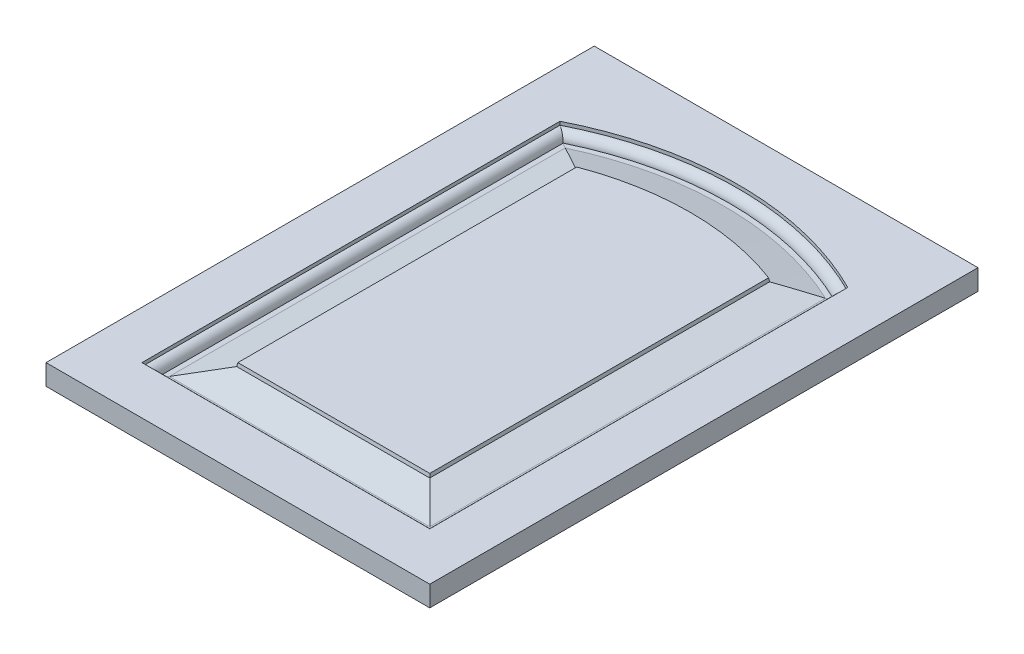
ISO-10303-21;
HEADER;
FILE_DESCRIPTION(('STEP AP214'),'2;1');
FILE_NAME('part.step','',(''),(''),'','','');
FILE_SCHEMA(('AUTOMOTIVE_DESIGN { 1 0 10303 214 1 1 1 1 }'));
ENDSEC;
DATA;
#1=APPLICATION_CONTEXT('core data for automotive mechanical design processes');
#2=APPLICATION_PROTOCOL_DEFINITION('international standard','automotive_design',2000,#1);
#3=PRODUCT_CONTEXT('',#1,'mechanical');
#4=PRODUCT('Part','Part','',(#3));
#5=PRODUCT_RELATED_PRODUCT_CATEGORY('part','',(#4));
#6=PRODUCT_DEFINITION_FORMATION('','',#4);
#7=PRODUCT_DEFINITION_CONTEXT('part definition',#1,'design');
#8=PRODUCT_DEFINITION('design','',#6,#7);
#9=PRODUCT_DEFINITION_SHAPE('','',#8);
#10=(LENGTH_UNIT() NAMED_UNIT(*) SI_UNIT(.MILLI.,.METRE.));
#11=(NAMED_UNIT(*) PLANE_ANGLE_UNIT() SI_UNIT($,.RADIAN.));
#12=(NAMED_UNIT(*) SI_UNIT($,.STERADIAN.) SOLID_ANGLE_UNIT());
#13=UNCERTAINTY_MEASURE_WITH_UNIT(LENGTH_MEASURE(1.E-05),#10,'distance_accuracy_value','');
#14=(GEOMETRIC_REPRESENTATION_CONTEXT(3) GLOBAL_UNCERTAINTY_ASSIGNED_CONTEXT((#13)) GLOBAL_UNIT_ASSIGNED_CONTEXT((#10,
#11,#12)) REPRESENTATION_CONTEXT('',''));
#15=CARTESIAN_POINT('',(0.,0.,0.));
#16=DIRECTION('',(0.,0.,1.));
#17=DIRECTION('',(1.,0.,0.));
#18=AXIS2_PLACEMENT_3D('',#15,#16,#17);
#19=CARTESIAN_POINT('',(0.,19.05,0.));
#20=DIRECTION('',(0.,-1.,0.));
#21=DIRECTION('',(0.,0.,-1.));
#22=AXIS2_PLACEMENT_3D('',#19,#20,#21);
#23=PLANE('',#22);
#24=DIRECTION('',(0.,0.,1.));
#25=VECTOR('',#24,1.);
#26=CARTESIAN_POINT('',(-177.8,19.05,0.));
#27=LINE('',#26,#25);
#28=CARTESIAN_POINT('',(-177.8,19.05,-508.));
#29=VERTEX_POINT('',#28);
#30=CARTESIAN_POINT('',(-177.8,19.05,0.));
#31=VERTEX_POINT('',#30);
#32=EDGE_CURVE('E338',#29,#31,#27,.T.);
#33=ORIENTED_EDGE('',*,*,#32,.T.);
#34=DIRECTION('',(1.,0.,0.));
#35=VECTOR('',#34,1.);
#36=CARTESIAN_POINT('',(-177.8,19.05,0.));
#37=LINE('',#36,#35);
#38=CARTESIAN_POINT('',(177.8,19.05,0.));
#39=VERTEX_POINT('',#38);
#40=EDGE_CURVE('E706',#31,#39,#37,.T.);
#41=ORIENTED_EDGE('',*,*,#40,.T.);
#42=DIRECTION('',(0.,0.,-1.));
#43=VECTOR('',#42,1.);
#44=CARTESIAN_POINT('',(177.8,19.05,0.));
#45=LINE('',#44,#43);
#46=CARTESIAN_POINT('',(177.8,19.05,-508.));
#47=VERTEX_POINT('',#46);
#48=EDGE_CURVE('E690',#39,#47,#45,.T.);
#49=ORIENTED_EDGE('',*,*,#48,.T.);
#50=DIRECTION('',(-1.,0.,0.));
#51=VECTOR('',#50,1.);
#52=CARTESIAN_POINT('',(-177.8,19.05,-508.));
#53=LINE('',#52,#51);
#54=EDGE_CURVE('E701',#47,#29,#53,.T.);
#55=ORIENTED_EDGE('',*,*,#54,.T.);
#56=EDGE_LOOP('',(#33,#41,#49,#55));
#57=FACE_BOUND('',#56,.T.);
#58=DIRECTION('',(0.,0.,1.));
#59=VECTOR('',#58,1.);
#60=CARTESIAN_POINT('',(-133.35,19.05,-431.8));
#61=LINE('',#60,#59);
#62=CARTESIAN_POINT('',(-133.35,19.05,-431.8));
#63=VERTEX_POINT('',#62);
#64=CARTESIAN_POINT('',(-133.35,19.05,-44.4499999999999));
#65=VERTEX_POINT('',#64);
#66=EDGE_CURVE('E330',#63,#65,#61,.T.);
#67=ORIENTED_EDGE('',*,*,#66,.F.);
#68=CARTESIAN_POINT('',(0.,19.05,-167.64));
#69=DIRECTION('',(0.,1.,0.));
#70=DIRECTION('',(0.450643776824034,0.,-0.892703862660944));
#71=AXIS2_PLACEMENT_3D('',#68,#69,#70);
#72=CIRCLE('',#71,295.91);
#73=CARTESIAN_POINT('',(133.35,19.05,-431.8));
#74=VERTEX_POINT('',#73);
#75=EDGE_CURVE('E376',#74,#63,#72,.T.);
#76=ORIENTED_EDGE('',*,*,#75,.F.);
#77=DIRECTION('',(0.,0.,-1.));
#78=VECTOR('',#77,1.);
#79=CARTESIAN_POINT('',(133.35,19.05,-44.45));
#80=LINE('',#79,#78);
#81=CARTESIAN_POINT('',(133.35,19.05,-44.45));
#82=VERTEX_POINT('',#81);
#83=EDGE_CURVE('E505',#82,#74,#80,.T.);
#84=ORIENTED_EDGE('',*,*,#83,.F.);
#85=DIRECTION('',(1.,0.,0.));
#86=VECTOR('',#85,1.);
#87=CARTESIAN_POINT('',(-133.35,19.05,-44.4499999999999));
#88=LINE('',#87,#86);
#89=EDGE_CURVE('E271',#65,#82,#88,.T.);
#90=ORIENTED_EDGE('',*,*,#89,.F.);
#91=EDGE_LOOP('',(#67,#76,#84,#90));
#92=FACE_BOUND('',#91,.T.);
#93=ADVANCED_FACE('F34',(#57,#92),#23,.F.);
#94=CARTESIAN_POINT('',(-177.8,19.05,0.));
#95=DIRECTION('',(1.,0.,0.));
#96=DIRECTION('',(0.,0.,-1.));
#97=AXIS2_PLACEMENT_3D('',#94,#95,#96);
#98=PLANE('',#97);
#99=DIRECTION('',(0.,0.,1.));
#100=VECTOR('',#99,1.);
#101=CARTESIAN_POINT('',(-177.8,0.,0.));
#102=LINE('',#101,#100);
#103=CARTESIAN_POINT('',(-177.8,0.,-508.));
#104=VERTEX_POINT('',#103);
#105=CARTESIAN_POINT('',(-177.8,0.,0.));
#106=VERTEX_POINT('',#105);
#107=EDGE_CURVE('E184',#104,#106,#102,.T.);
#108=ORIENTED_EDGE('',*,*,#107,.T.);
#109=DIRECTION('',(0.,-1.,0.));
#110=VECTOR('',#109,1.);
#111=CARTESIAN_POINT('',(-177.8,19.05,0.));
#112=LINE('',#111,#110);
#113=EDGE_CURVE('E11',#31,#106,#112,.T.);
#114=ORIENTED_EDGE('',*,*,#113,.F.);
#115=ORIENTED_EDGE('',*,*,#32,.F.);
#116=DIRECTION('',(0.,-1.,0.));
#117=VECTOR('',#116,1.);
#118=CARTESIAN_POINT('',(-177.8,19.05,-508.));
#119=LINE('',#118,#117);
#120=EDGE_CURVE('E698',#29,#104,#119,.T.);
#121=ORIENTED_EDGE('',*,*,#120,.T.);
#122=EDGE_LOOP('',(#108,#114,#115,#121));
#123=FACE_BOUND('',#122,.T.);
#124=ADVANCED_FACE('F36',(#123),#98,.F.);
#125=CARTESIAN_POINT('',(-177.8,19.05,0.));
#126=DIRECTION('',(0.,0.,-1.));
#127=DIRECTION('',(-1.,0.,0.));
#128=AXIS2_PLACEMENT_3D('',#125,#126,#127);
#129=PLANE('',#128);
#130=DIRECTION('',(1.,0.,0.));
#131=VECTOR('',#130,1.);
#132=CARTESIAN_POINT('',(-177.8,0.,0.));
#133=LINE('',#132,#131);
#134=CARTESIAN_POINT('',(177.8,0.,0.));
#135=VERTEX_POINT('',#134);
#136=EDGE_CURVE('E679',#106,#135,#133,.T.);
#137=ORIENTED_EDGE('',*,*,#136,.T.);
#138=DIRECTION('',(0.,-1.,0.));
#139=VECTOR('',#138,1.);
#140=CARTESIAN_POINT('',(177.8,19.05,0.));
#141=LINE('',#140,#139);
#142=EDGE_CURVE('E42',#39,#135,#141,.T.);
#143=ORIENTED_EDGE('',*,*,#142,.F.);
#144=ORIENTED_EDGE('',*,*,#40,.F.);
#145=ORIENTED_EDGE('',*,*,#113,.T.);
#146=EDGE_LOOP('',(#137,#143,#144,#145));
#147=FACE_BOUND('',#146,.T.);
#148=ADVANCED_FACE('F441',(#147),#129,.F.);
#149=CARTESIAN_POINT('',(177.8,19.05,0.));
#150=DIRECTION('',(-1.,0.,0.));
#151=DIRECTION('',(0.,0.,1.));
#152=AXIS2_PLACEMENT_3D('',#149,#150,#151);
#153=PLANE('',#152);
#154=DIRECTION('',(0.,0.,-1.));
#155=VECTOR('',#154,1.);
#156=CARTESIAN_POINT('',(177.8,0.,0.));
#157=LINE('',#156,#155);
#158=CARTESIAN_POINT('',(177.8,0.,-508.));
#159=VERTEX_POINT('',#158);
#160=EDGE_CURVE('E686',#135,#159,#157,.T.);
#161=ORIENTED_EDGE('',*,*,#160,.T.);
#162=DIRECTION('',(0.,-1.,0.));
#163=VECTOR('',#162,1.);
#164=CARTESIAN_POINT('',(177.8,19.05,-508.));
#165=LINE('',#164,#163);
#166=EDGE_CURVE('E691',#47,#159,#165,.T.);
#167=ORIENTED_EDGE('',*,*,#166,.F.);
#168=ORIENTED_EDGE('',*,*,#48,.F.);
#169=ORIENTED_EDGE('',*,*,#142,.T.);
#170=EDGE_LOOP('',(#161,#167,#168,#169));
#171=FACE_BOUND('',#170,.T.);
#172=ADVANCED_FACE('F650',(#171),#153,.F.);
#173=CARTESIAN_POINT('',(-177.8,19.05,-508.));
#174=DIRECTION('',(0.,0.,1.));
#175=DIRECTION('',(1.,0.,0.));
#176=AXIS2_PLACEMENT_3D('',#173,#174,#175);
#177=PLANE('',#176);
#178=DIRECTION('',(-1.,0.,0.));
#179=VECTOR('',#178,1.);
#180=CARTESIAN_POINT('',(-177.8,0.,-508.));
#181=LINE('',#180,#179);
#182=EDGE_CURVE('E693',#159,#104,#181,.T.);
#183=ORIENTED_EDGE('',*,*,#182,.T.);
#184=ORIENTED_EDGE('',*,*,#120,.F.);
#185=ORIENTED_EDGE('',*,*,#54,.F.);
#186=ORIENTED_EDGE('',*,*,#166,.T.);
#187=EDGE_LOOP('',(#183,#184,#185,#186));
#188=FACE_BOUND('',#187,.T.);
#189=ADVANCED_FACE('F641',(#188),#177,.F.);
#190=CARTESIAN_POINT('',(0.,0.,0.));
#191=DIRECTION('',(0.,-1.,0.));
#192=DIRECTION('',(0.,0.,-1.));
#193=AXIS2_PLACEMENT_3D('',#190,#191,#192);
#194=PLANE('',#193);
#195=ORIENTED_EDGE('',*,*,#107,.F.);
#196=ORIENTED_EDGE('',*,*,#182,.F.);
#197=ORIENTED_EDGE('',*,*,#160,.F.);
#198=ORIENTED_EDGE('',*,*,#136,.F.);
#199=EDGE_LOOP('',(#195,#196,#197,#198));
#200=FACE_BOUND('',#199,.T.);
#201=ADVANCED_FACE('F296',(#200),#194,.T.);
#202=CARTESIAN_POINT('',(-133.35,19.05,-431.8));
#203=DIRECTION('',(1.,0.,0.));
#204=DIRECTION('',(0.,0.,-1.));
#205=AXIS2_PLACEMENT_3D('',#202,#203,#204);
#206=PLANE('',#205);
#207=ORIENTED_EDGE('',*,*,#66,.T.);
#208=DIRECTION('',(0.,1.,0.));
#209=VECTOR('',#208,1.);
#210=CARTESIAN_POINT('',(-133.35,19.05,-44.4499999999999));
#211=LINE('',#210,#209);
#212=CARTESIAN_POINT('',(-133.35,15.875,-44.45));
#213=VERTEX_POINT('',#212);
#214=EDGE_CURVE('E170',#213,#65,#211,.T.);
#215=ORIENTED_EDGE('',*,*,#214,.F.);
#216=DIRECTION('',(0.,0.,1.));
#217=VECTOR('',#216,1.);
#218=CARTESIAN_POINT('',(-133.35,15.875,-431.8));
#219=LINE('',#218,#217);
#220=CARTESIAN_POINT('',(-133.35,15.875,-431.8));
#221=VERTEX_POINT('',#220);
#222=EDGE_CURVE('E321',#221,#213,#219,.T.);
#223=ORIENTED_EDGE('',*,*,#222,.F.);
#224=DIRECTION('',(0.,1.,0.));
#225=VECTOR('',#224,1.);
#226=CARTESIAN_POINT('',(-133.35,19.05,-431.8));
#227=LINE('',#226,#225);
#228=EDGE_CURVE('E337',#221,#63,#227,.T.);
#229=ORIENTED_EDGE('',*,*,#228,.T.);
#230=EDGE_LOOP('',(#207,#215,#223,#229));
#231=FACE_BOUND('',#230,.T.);
#232=ADVANCED_FACE('F285',(#231),#206,.T.);
#233=CARTESIAN_POINT('',(-125.4125,7.9375,-431.8));
#234=DIRECTION('',(0.,1.,0.));
#235=DIRECTION('',(0.,0.,1.));
#236=AXIS2_PLACEMENT_3D('',#233,#234,#235);
#237=PLANE('',#236);
#238=DIRECTION('',(0.,0.,1.));
#239=VECTOR('',#238,1.);
#240=CARTESIAN_POINT('',(-125.4125,7.9375,-431.8));
#241=LINE('',#240,#239);
#242=CARTESIAN_POINT('',(-125.4125,7.9375,-426.869368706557));
#243=VERTEX_POINT('',#242);
#244=CARTESIAN_POINT('',(-125.4125,7.9375,-52.3875));
#245=VERTEX_POINT('',#244);
#246=EDGE_CURVE('E329',#243,#245,#241,.T.);
#247=ORIENTED_EDGE('',*,*,#246,.T.);
#248=DIRECTION('',(0.707106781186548,0.,-0.707106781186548));
#249=VECTOR('',#248,1.);
#250=CARTESIAN_POINT('',(-129.38125,7.9375,-48.4187499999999));
#251=LINE('',#250,#249);
#252=CARTESIAN_POINT('',(-120.65,7.9375,-57.1499999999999));
#253=VERTEX_POINT('',#252);
#254=EDGE_CURVE('E519',#245,#253,#251,.T.);
#255=ORIENTED_EDGE('',*,*,#254,.T.);
#256=DIRECTION('',(0.,0.,1.));
#257=VECTOR('',#256,1.);
#258=CARTESIAN_POINT('',(-120.65,7.9375,-431.8));
#259=LINE('',#258,#257);
#260=CARTESIAN_POINT('',(-120.650000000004,7.9375,-423.865450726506));
#261=VERTEX_POINT('',#260);
#262=EDGE_CURVE('E743',#261,#253,#259,.T.);
#263=ORIENTED_EDGE('',*,*,#262,.F.);
#264=DIRECTION('',(0.845807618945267,0.,0.533488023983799));
#265=VECTOR('',#264,1.);
#266=CARTESIAN_POINT('',(-125.4125,7.9375,-426.869368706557));
#267=LINE('',#266,#265);
#268=EDGE_CURVE('E461',#243,#261,#267,.T.);
#269=ORIENTED_EDGE('',*,*,#268,.F.);
#270=EDGE_LOOP('',(#247,#255,#263,#269));
#271=FACE_BOUND('',#270,.T.);
#272=ADVANCED_FACE('F295',(#271),#237,.T.);
#273=CARTESIAN_POINT('',(-133.35,7.9375,-431.8));
#274=DIRECTION('',(0.,0.,1.));
#275=DIRECTION('',(1.,0.,0.));
#276=AXIS2_PLACEMENT_3D('',#273,#274,#275);
#277=CYLINDRICAL_SURFACE('',#276,7.93750000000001);
#278=ORIENTED_EDGE('',*,*,#222,.T.);
#279=CARTESIAN_POINT('',(-133.35,7.9375,-44.4499999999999));
#280=DIRECTION('',(0.707106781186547,0.,0.707106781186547));
#281=DIRECTION('',(0.707106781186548,0.,-0.707106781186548));
#282=AXIS2_PLACEMENT_3D('',#279,#280,#281);
#283=ELLIPSE('',#282,11.2253201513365,7.93750000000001);
#284=EDGE_CURVE('E260',#213,#245,#283,.F.);
#285=ORIENTED_EDGE('',*,*,#284,.T.);
#286=ORIENTED_EDGE('',*,*,#246,.F.);
#287=CARTESIAN_POINT('',(-125.412500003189,7.937275,-426.869368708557));
#288=CARTESIAN_POINT('',(-125.412456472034,8.13634286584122,-426.869340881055));
#289=CARTESIAN_POINT('',(-125.419975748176,8.33539467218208,-426.874056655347));
#290=CARTESIAN_POINT('',(-125.449858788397,8.73186642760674,-426.892795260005));
#291=CARTESIAN_POINT('',(-125.472216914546,8.9292869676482,-426.906814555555));
#292=CARTESIAN_POINT('',(-125.531357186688,9.32012652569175,-426.943892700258));
#293=CARTESIAN_POINT('',(-125.568070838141,9.51356002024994,-426.966908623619));
#294=CARTESIAN_POINT('',(-125.655414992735,9.8960027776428,-427.021654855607));
#295=CARTESIAN_POINT('',(-125.706046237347,10.0850118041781,-427.053385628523));
#296=CARTESIAN_POINT('',(-125.820494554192,10.4570815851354,-427.12509411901));
#297=CARTESIAN_POINT('',(-125.88429332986,10.6401501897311,-427.165060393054));
#298=CARTESIAN_POINT('',(-126.024377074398,10.9995869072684,-427.252790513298));
#299=CARTESIAN_POINT('',(-126.100666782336,11.1759524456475,-427.300557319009));
#300=CARTESIAN_POINT('',(-126.264911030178,11.5210681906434,-427.403361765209));
#301=CARTESIAN_POINT('',(-126.352871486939,11.6898144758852,-427.458403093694));
#302=CARTESIAN_POINT('',(-126.539567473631,12.0188872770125,-427.575186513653));
#303=CARTESIAN_POINT('',(-126.638307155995,12.1792105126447,-427.636931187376));
#304=CARTESIAN_POINT('',(-126.851622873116,12.4997540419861,-427.77027105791));
#305=CARTESIAN_POINT('',(-126.966784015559,12.6594342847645,-427.842229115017));
#306=CARTESIAN_POINT('',(-127.207073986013,12.968072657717,-427.992305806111));
#307=CARTESIAN_POINT('',(-127.332206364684,13.1170269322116,-428.0704266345));
#308=CARTESIAN_POINT('',(-127.720940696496,13.547022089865,-428.312998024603));
#309=CARTESIAN_POINT('',(-127.998032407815,13.8114216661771,-428.485752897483));
#310=CARTESIAN_POINT('',(-128.622449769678,14.3282431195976,-428.874621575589));
#311=CARTESIAN_POINT('',(-128.974131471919,14.5733516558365,-429.093388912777));
#312=CARTESIAN_POINT('',(-129.704517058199,15.0010478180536,-429.547116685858));
#313=CARTESIAN_POINT('',(-130.083254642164,15.183555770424,-429.782097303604));
#314=CARTESIAN_POINT('',(-130.931762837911,15.5138181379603,-430.307793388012));
#315=CARTESIAN_POINT('',(-131.40525082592,15.6485667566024,-430.600675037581));
#316=CARTESIAN_POINT('',(-132.363999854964,15.8285592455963,-431.192697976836));
#317=CARTESIAN_POINT('',(-132.849232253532,15.8740022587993,-431.491823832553));
#318=CARTESIAN_POINT('',(-133.339292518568,15.8749945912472,-431.793410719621));
#319=CARTESIAN_POINT('',(-133.344646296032,15.8750000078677,-431.796705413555));
#320=CARTESIAN_POINT('',(-133.35,15.875,-431.8));
#321=B_SPLINE_CURVE_WITH_KNOTS('',3,(#287,#288,#289,#290,#291,#292,#293,#294,#295,#296,#297,
#298,#299,#300,#301,#302,#303,#304,#305,#306,#307,#308,#309,#310,#311,#312,#313,#314,#315,#316,
#317,#318,#319,#320),.UNSPECIFIED.,.F.,.F.,(4,2,2,2,2,2,2,2,2,2,2,2,2,2,2,2,4),(0.,
0.596980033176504,1.19373337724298,1.78767350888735,2.38164528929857,2.97479722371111,
3.56817472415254,4.16185421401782,4.75576321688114,5.3839518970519,6.01236527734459,
7.26833315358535,8.706665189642,10.1468210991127,11.8580267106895,13.5654121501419,
13.5842711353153),.UNSPECIFIED.);
#322=EDGE_CURVE('E374',#243,#221,#321,.T.);
#323=ORIENTED_EDGE('',*,*,#322,.T.);
#324=EDGE_LOOP('',(#278,#285,#286,#323));
#325=FACE_BOUND('',#324,.T.);
#326=ADVANCED_FACE('F303',(#325),#277,.T.);
#327=CARTESIAN_POINT('',(-120.65,7.9375,-431.8));
#328=DIRECTION('',(-0.24662634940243,0.969110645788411,0.));
#329=DIRECTION('',(-0.969110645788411,-0.24662634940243,0.));
#330=AXIS2_PLACEMENT_3D('',#327,#328,#329);
#331=PLANE('',#330);
#332=ORIENTED_EDGE('',*,*,#262,.T.);
#333=DIRECTION('',(0.695928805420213,0.177105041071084,-0.695928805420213));
#334=VECTOR('',#333,1.);
#335=CARTESIAN_POINT('',(-126.800824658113,6.37219325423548,-50.9991753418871));
#336=LINE('',#335,#334);
#337=CARTESIAN_POINT('',(-89.4598381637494,15.875,-88.3401618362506));
#338=VERTEX_POINT('',#337);
#339=EDGE_CURVE('E745',#253,#338,#336,.T.);
#340=ORIENTED_EDGE('',*,*,#339,.T.);
#341=DIRECTION('',(0.,0.,1.));
#342=VECTOR('',#341,1.);
#343=CARTESIAN_POINT('',(-89.4598381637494,15.875,-431.8));
#344=LINE('',#343,#342);
#345=CARTESIAN_POINT('',(-89.4598381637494,15.875,-403.247589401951));
#346=VERTEX_POINT('',#345);
#347=EDGE_CURVE('E747',#346,#338,#344,.T.);
#348=ORIENTED_EDGE('',*,*,#347,.F.);
#349=CARTESIAN_POINT('',(-120.6502,7.93744910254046,-423.865577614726));
#350=CARTESIAN_POINT('',(-118.02039744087,8.60670044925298,-422.197107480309));
#351=CARTESIAN_POINT('',(-115.397618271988,9.27416443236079,-420.516827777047));
#352=CARTESIAN_POINT('',(-110.167227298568,10.6052324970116,-417.131861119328));
#353=CARTESIAN_POINT('',(-107.559614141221,11.2688369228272,-415.427176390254));
#354=CARTESIAN_POINT('',(-102.360166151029,12.592030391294,-411.992287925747));
#355=CARTESIAN_POINT('',(-99.7683315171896,13.2516193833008,-410.262083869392));
#356=CARTESIAN_POINT('',(-94.6012402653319,14.566578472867,-406.774996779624));
#357=CARTESIAN_POINT('',(-92.025985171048,15.2219481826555,-405.018111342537));
#358=CARTESIAN_POINT('',(-89.4596381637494,15.8750508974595,-403.247451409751));
#359=B_SPLINE_CURVE_WITH_KNOTS('',3,(#349,#350,#351,#352,#353,#354,#355,#356,#357,#358),
.UNSPECIFIED.,.F.,.F.,(4,2,2,2,4),(0.,9.55655330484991,19.1122406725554,28.6680483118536,
38.2247219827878),.UNSPECIFIED.);
#360=EDGE_CURVE('E395',#261,#346,#359,.T.);
#361=ORIENTED_EDGE('',*,*,#360,.F.);
#362=EDGE_LOOP('',(#332,#340,#348,#361));
#363=FACE_BOUND('',#362,.T.);
#364=ADVANCED_FACE('F308',(#363),#331,.T.);
#365=CARTESIAN_POINT('',(-89.4598381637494,15.875,-431.8));
#366=DIRECTION('',(-0.984807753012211,0.173648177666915,0.));
#367=DIRECTION('',(-0.173648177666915,-0.984807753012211,0.));
#368=AXIS2_PLACEMENT_3D('',#365,#366,#367);
#369=PLANE('',#368);
#370=ORIENTED_EDGE('',*,*,#347,.T.);
#371=DIRECTION('',(0.171087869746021,0.970287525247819,-0.171087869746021));
#372=VECTOR('',#371,1.);
#373=CARTESIAN_POINT('',(-90.7445496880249,8.5890388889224,-87.0554503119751));
#374=LINE('',#373,#372);
#375=CARTESIAN_POINT('',(-88.9000000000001,19.05,-88.8999999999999));
#376=VERTEX_POINT('',#375);
#377=EDGE_CURVE('E169',#338,#376,#374,.T.);
#378=ORIENTED_EDGE('',*,*,#377,.T.);
#379=DIRECTION('',(0.,0.,1.));
#380=VECTOR('',#379,1.);
#381=CARTESIAN_POINT('',(-88.9000000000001,19.05,-431.8));
#382=LINE('',#381,#380);
#383=CARTESIAN_POINT('',(-88.9000000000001,19.05,-402.861005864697));
#384=VERTEX_POINT('',#383);
#385=EDGE_CURVE('E451',#384,#376,#382,.T.);
#386=ORIENTED_EDGE('',*,*,#385,.F.);
#387=CARTESIAN_POINT('',(-89.4598734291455,15.8748,-403.24761373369));
#388=CARTESIAN_POINT('',(-89.3665542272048,16.4040394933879,-403.183227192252));
#389=CARTESIAN_POINT('',(-89.273235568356,16.9332759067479,-403.118814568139));
#390=CARTESIAN_POINT('',(-89.0865993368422,17.9917425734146,-402.989937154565));
#391=CARTESIAN_POINT('',(-88.993281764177,18.5209728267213,-402.925472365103));
#392=CARTESIAN_POINT('',(-88.8999647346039,19.0502,-402.860981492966));
#393=B_SPLINE_CURVE_WITH_KNOTS('',3,(#387,#388,#389,#390,#391,#392),.UNSPECIFIED.,.F.,.F.,(4,2,
4),(0.,1.62374162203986,3.24748324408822),.UNSPECIFIED.);
#394=EDGE_CURVE('E400',#346,#384,#393,.T.);
#395=ORIENTED_EDGE('',*,*,#394,.F.);
#396=EDGE_LOOP('',(#370,#378,#386,#395));
#397=FACE_BOUND('',#396,.T.);
#398=ADVANCED_FACE('F362',(#397),#369,.T.);
#399=CARTESIAN_POINT('',(0.,7.9375,-167.64));
#400=DIRECTION('',(0.,1.,0.));
#401=DIRECTION('',(0.,0.,1.));
#402=AXIS2_PLACEMENT_3D('',#399,#400,#401);
#403=TOROIDAL_SURFACE('',#402,295.91,7.93750000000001);
#404=ORIENTED_EDGE('',*,*,#322,.F.);
#405=CARTESIAN_POINT('',(0.,7.9375,-167.64));
#406=DIRECTION('',(0.,1.,0.));
#407=DIRECTION('',(0.450643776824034,0.,-0.892703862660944));
#408=AXIS2_PLACEMENT_3D('',#405,#406,#407);
#409=CIRCLE('',#408,287.9725);
#410=CARTESIAN_POINT('',(125.4125,7.9375,-426.869368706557));
#411=VERTEX_POINT('',#410);
#412=EDGE_CURVE('E248',#411,#243,#409,.T.);
#413=ORIENTED_EDGE('',*,*,#412,.F.);
#414=CARTESIAN_POINT('',(125.412500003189,7.937275,-426.869368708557));
#415=CARTESIAN_POINT('',(125.412456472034,8.13634286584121,-426.869340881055));
#416=CARTESIAN_POINT('',(125.419975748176,8.33539467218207,-426.874056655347));
#417=CARTESIAN_POINT('',(125.449858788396,8.73186642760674,-426.892795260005));
#418=CARTESIAN_POINT('',(125.472216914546,8.9292869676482,-426.906814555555));
#419=CARTESIAN_POINT('',(125.531357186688,9.32012652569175,-426.943892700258));
#420=CARTESIAN_POINT('',(125.568070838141,9.51356002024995,-426.966908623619));
#421=CARTESIAN_POINT('',(125.655414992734,9.8960027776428,-427.021654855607));
#422=CARTESIAN_POINT('',(125.706046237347,10.0850118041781,-427.053385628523));
#423=CARTESIAN_POINT('',(125.820494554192,10.4570815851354,-427.12509411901));
#424=CARTESIAN_POINT('',(125.88429332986,10.6401501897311,-427.165060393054));
#425=CARTESIAN_POINT('',(126.024377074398,10.9995869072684,-427.252790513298));
#426=CARTESIAN_POINT('',(126.100666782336,11.1759524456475,-427.300557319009));
#427=CARTESIAN_POINT('',(126.264911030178,11.5210681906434,-427.403361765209));
#428=CARTESIAN_POINT('',(126.352871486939,11.6898144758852,-427.458403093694));
#429=CARTESIAN_POINT('',(126.539567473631,12.0188872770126,-427.575186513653));
#430=CARTESIAN_POINT('',(126.638307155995,12.1792105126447,-427.636931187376));
#431=CARTESIAN_POINT('',(126.851622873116,12.4997540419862,-427.77027105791));
#432=CARTESIAN_POINT('',(126.966784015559,12.6594342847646,-427.842229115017));
#433=CARTESIAN_POINT('',(127.207073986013,12.968072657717,-427.992305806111));
#434=CARTESIAN_POINT('',(127.332206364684,13.1170269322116,-428.0704266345));
#435=CARTESIAN_POINT('',(127.720940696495,13.547022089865,-428.312998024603));
#436=CARTESIAN_POINT('',(127.998032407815,13.8114216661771,-428.485752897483));
#437=CARTESIAN_POINT('',(128.622449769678,14.3282431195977,-428.874621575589));
#438=CARTESIAN_POINT('',(128.974131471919,14.5733516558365,-429.093388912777));
#439=CARTESIAN_POINT('',(129.704517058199,15.0010478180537,-429.547116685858));
#440=CARTESIAN_POINT('',(130.083254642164,15.183555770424,-429.782097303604));
#441=CARTESIAN_POINT('',(130.931762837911,15.5138181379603,-430.307793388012));
#442=CARTESIAN_POINT('',(131.40525082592,15.6485667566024,-430.600675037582));
#443=CARTESIAN_POINT('',(132.363999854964,15.8285592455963,-431.192697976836));
#444=CARTESIAN_POINT('',(132.849232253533,15.8740022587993,-431.491823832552));
#445=CARTESIAN_POINT('',(133.339292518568,15.8749945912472,-431.793410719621));
#446=CARTESIAN_POINT('',(133.344646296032,15.8750000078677,-431.796705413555));
#447=CARTESIAN_POINT('',(133.35,15.875,-431.8));
#448=B_SPLINE_CURVE_WITH_KNOTS('',3,(#414,#415,#416,#417,#418,#419,#420,#421,#422,#423,#424,
#425,#426,#427,#428,#429,#430,#431,#432,#433,#434,#435,#436,#437,#438,#439,#440,#441,#442,#443,
#444,#445,#446,#447),.UNSPECIFIED.,.F.,.F.,(4,2,2,2,2,2,2,2,2,2,2,2,2,2,2,2,4),(0.,
0.596980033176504,1.19373337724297,1.78767350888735,2.38164528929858,2.97479722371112,
3.56817472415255,4.16185421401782,4.75576321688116,5.38395189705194,6.0123652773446,
7.26833315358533,8.70666518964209,10.1468210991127,11.8580267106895,13.5654121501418,
13.5842711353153),.UNSPECIFIED.);
#449=CARTESIAN_POINT('',(133.35,15.875,-431.8));
#450=VERTEX_POINT('',#449);
#451=EDGE_CURVE('E207',#411,#450,#448,.T.);
#452=ORIENTED_EDGE('',*,*,#451,.T.);
#453=CARTESIAN_POINT('',(0.,15.875,-167.64));
#454=DIRECTION('',(0.,1.,0.));
#455=DIRECTION('',(0.450643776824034,0.,-0.892703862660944));
#456=AXIS2_PLACEMENT_3D('',#453,#454,#455);
#457=CIRCLE('',#456,295.91);
#458=EDGE_CURVE('E333',#450,#221,#457,.T.);
#459=ORIENTED_EDGE('',*,*,#458,.T.);
#460=EDGE_LOOP('',(#404,#413,#452,#459));
#461=FACE_BOUND('',#460,.T.);
#462=ADVANCED_FACE('F352',(#461),#403,.T.);
#463=CARTESIAN_POINT('',(0.,19.05,-167.64));
#464=DIRECTION('',(0.,1.,0.));
#465=DIRECTION('',(0.,0.,1.));
#466=AXIS2_PLACEMENT_3D('',#463,#464,#465);
#467=CYLINDRICAL_SURFACE('',#466,295.91);
#468=ORIENTED_EDGE('',*,*,#75,.T.);
#469=ORIENTED_EDGE('',*,*,#228,.F.);
#470=ORIENTED_EDGE('',*,*,#458,.F.);
#471=DIRECTION('',(0.,1.,0.));
#472=VECTOR('',#471,1.);
#473=CARTESIAN_POINT('',(133.35,19.05,-431.8));
#474=LINE('',#473,#472);
#475=EDGE_CURVE('E265',#450,#74,#474,.T.);
#476=ORIENTED_EDGE('',*,*,#475,.T.);
#477=EDGE_LOOP('',(#468,#469,#470,#476));
#478=FACE_BOUND('',#477,.T.);
#479=ADVANCED_FACE('F361',(#478),#467,.F.);
#480=CARTESIAN_POINT('',(0.,15.875,-167.64));
#481=DIRECTION('',(0.,-1.,0.));
#482=DIRECTION('',(0.,0.,-1.));
#483=AXIS2_PLACEMENT_3D('',#480,#481,#482);
#484=CONICAL_SURFACE('',#483,252.019838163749,1.32159880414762);
#485=CARTESIAN_POINT('',(0.,7.9375,-167.64));
#486=DIRECTION('',(0.,1.,0.));
#487=DIRECTION('',(0.450643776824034,0.,-0.892703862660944));
#488=AXIS2_PLACEMENT_3D('',#485,#486,#487);
#489=CIRCLE('',#488,283.21);
#490=CARTESIAN_POINT('',(120.65,7.9375,-423.865450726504));
#491=VERTEX_POINT('',#490);
#492=EDGE_CURVE('E245',#491,#261,#489,.T.);
#493=ORIENTED_EDGE('',*,*,#492,.T.);
#494=ORIENTED_EDGE('',*,*,#360,.T.);
#495=CARTESIAN_POINT('',(0.,15.875,-167.64));
#496=DIRECTION('',(0.,1.,0.));
#497=DIRECTION('',(0.450643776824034,0.,-0.892703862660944));
#498=AXIS2_PLACEMENT_3D('',#495,#496,#497);
#499=CIRCLE('',#498,252.019838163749);
#500=CARTESIAN_POINT('',(89.4598381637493,15.875,-403.247589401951));
#501=VERTEX_POINT('',#500);
#502=EDGE_CURVE('E249',#501,#346,#499,.T.);
#503=ORIENTED_EDGE('',*,*,#502,.F.);
#504=CARTESIAN_POINT('',(120.6502,7.93744910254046,-423.865577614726));
#505=CARTESIAN_POINT('',(118.02039744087,8.60670044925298,-422.197107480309));
#506=CARTESIAN_POINT('',(115.397618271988,9.27416443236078,-420.516827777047));
#507=CARTESIAN_POINT('',(110.167227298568,10.6052324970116,-417.131861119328));
#508=CARTESIAN_POINT('',(107.559614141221,11.2688369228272,-415.427176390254));
#509=CARTESIAN_POINT('',(102.360166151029,12.592030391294,-411.992287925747));
#510=CARTESIAN_POINT('',(99.7683315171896,13.2516193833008,-410.262083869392));
#511=CARTESIAN_POINT('',(94.6012402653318,14.566578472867,-406.774996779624));
#512=CARTESIAN_POINT('',(92.0259851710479,15.2219481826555,-405.018111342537));
#513=CARTESIAN_POINT('',(89.4596381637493,15.8750508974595,-403.247451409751));
#514=B_SPLINE_CURVE_WITH_KNOTS('',3,(#504,#505,#506,#507,#508,#509,#510,#511,#512,#513),
.UNSPECIFIED.,.F.,.F.,(4,2,2,2,4),(0.,9.55655330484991,19.1122406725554,28.6680483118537,
38.2247219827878),.UNSPECIFIED.);
#515=EDGE_CURVE('E181',#491,#501,#514,.T.);
#516=ORIENTED_EDGE('',*,*,#515,.F.);
#517=EDGE_LOOP('',(#493,#494,#503,#516));
#518=FACE_BOUND('',#517,.T.);
#519=ADVANCED_FACE('F419',(#518),#484,.T.);
#520=CARTESIAN_POINT('',(0.,19.05,-167.64));
#521=DIRECTION('',(0.,-1.,0.));
#522=DIRECTION('',(0.,0.,-1.));
#523=AXIS2_PLACEMENT_3D('',#520,#521,#522);
#524=CONICAL_SURFACE('',#523,251.46,0.174532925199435);
#525=ORIENTED_EDGE('',*,*,#502,.T.);
#526=ORIENTED_EDGE('',*,*,#394,.T.);
#527=CARTESIAN_POINT('',(0.,19.05,-167.64));
#528=DIRECTION('',(0.,1.,0.));
#529=DIRECTION('',(0.450643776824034,0.,-0.892703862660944));
#530=AXIS2_PLACEMENT_3D('',#527,#528,#529);
#531=CIRCLE('',#530,251.46);
#532=CARTESIAN_POINT('',(88.9,19.05,-402.861005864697));
#533=VERTEX_POINT('',#532);
#534=EDGE_CURVE('E379',#533,#384,#531,.T.);
#535=ORIENTED_EDGE('',*,*,#534,.F.);
#536=CARTESIAN_POINT('',(89.4598734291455,15.8748,-403.24761373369));
#537=CARTESIAN_POINT('',(89.3665542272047,16.4040394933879,-403.183227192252));
#538=CARTESIAN_POINT('',(89.273235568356,16.9332759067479,-403.118814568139));
#539=CARTESIAN_POINT('',(89.0865993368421,17.9917425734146,-402.989937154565));
#540=CARTESIAN_POINT('',(88.993281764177,18.5209728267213,-402.925472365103));
#541=CARTESIAN_POINT('',(88.8999647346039,19.0502,-402.860981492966));
#542=B_SPLINE_CURVE_WITH_KNOTS('',3,(#536,#537,#538,#539,#540,#541),.UNSPECIFIED.,.F.,.F.,(4,2,
4),(0.,1.62374162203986,3.24748324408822),.UNSPECIFIED.);
#543=EDGE_CURVE('E57',#501,#533,#542,.T.);
#544=ORIENTED_EDGE('',*,*,#543,.F.);
#545=EDGE_LOOP('',(#525,#526,#535,#544));
#546=FACE_BOUND('',#545,.T.);
#547=ADVANCED_FACE('F423',(#546),#524,.T.);
#548=CARTESIAN_POINT('',(129.773015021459,7.9375,-424.714163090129));
#549=DIRECTION('',(0.,1.,0.));
#550=DIRECTION('',(0.,0.,1.));
#551=AXIS2_PLACEMENT_3D('',#548,#549,#550);
#552=PLANE('',#551);
#553=ORIENTED_EDGE('',*,*,#412,.T.);
#554=ORIENTED_EDGE('',*,*,#268,.T.);
#555=ORIENTED_EDGE('',*,*,#492,.F.);
#556=DIRECTION('',(-0.845807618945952,0.,0.533488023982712));
#557=VECTOR('',#556,1.);
#558=CARTESIAN_POINT('',(125.4125,7.9375,-426.869368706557));
#559=LINE('',#558,#557);
#560=EDGE_CURVE('E198',#411,#491,#559,.T.);
#561=ORIENTED_EDGE('',*,*,#560,.F.);
#562=EDGE_LOOP('',(#553,#554,#555,#561));
#563=FACE_BOUND('',#562,.T.);
#564=ADVANCED_FACE('F426',(#563),#552,.T.);
#565=CARTESIAN_POINT('',(-133.35,19.05,-44.4499999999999));
#566=DIRECTION('',(0.,0.,-1.));
#567=DIRECTION('',(-1.,0.,0.));
#568=AXIS2_PLACEMENT_3D('',#565,#566,#567);
#569=PLANE('',#568);
#570=ORIENTED_EDGE('',*,*,#89,.T.);
#571=DIRECTION('',(0.,1.,0.));
#572=VECTOR('',#571,1.);
#573=CARTESIAN_POINT('',(133.35,19.05,-44.45));
#574=LINE('',#573,#572);
#575=CARTESIAN_POINT('',(133.35,15.875,-44.45));
#576=VERTEX_POINT('',#575);
#577=EDGE_CURVE('E49',#576,#82,#574,.T.);
#578=ORIENTED_EDGE('',*,*,#577,.F.);
#579=DIRECTION('',(1.,0.,0.));
#580=VECTOR('',#579,1.);
#581=CARTESIAN_POINT('',(-133.35,15.875,-44.4499999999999));
#582=LINE('',#581,#580);
#583=EDGE_CURVE('E194',#213,#576,#582,.T.);
#584=ORIENTED_EDGE('',*,*,#583,.F.);
#585=ORIENTED_EDGE('',*,*,#214,.T.);
#586=EDGE_LOOP('',(#570,#578,#584,#585));
#587=FACE_BOUND('',#586,.T.);
#588=ADVANCED_FACE('F432',(#587),#569,.T.);
#589=CARTESIAN_POINT('',(-133.35,7.9375,-57.1499999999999));
#590=DIRECTION('',(0.,0.969110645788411,0.24662634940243));
#591=DIRECTION('',(0.,-0.24662634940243,0.969110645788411));
#592=AXIS2_PLACEMENT_3D('',#589,#590,#591);
#593=PLANE('',#592);
#594=DIRECTION('',(1.,0.,0.));
#595=VECTOR('',#594,1.);
#596=CARTESIAN_POINT('',(-133.35,7.9375,-57.1499999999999));
#597=LINE('',#596,#595);
#598=CARTESIAN_POINT('',(120.65,7.9375,-57.15));
#599=VERTEX_POINT('',#598);
#600=EDGE_CURVE('E156',#253,#599,#597,.T.);
#601=ORIENTED_EDGE('',*,*,#600,.T.);
#602=DIRECTION('',(-0.695928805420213,0.177105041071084,-0.695928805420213));
#603=VECTOR('',#602,1.);
#604=CARTESIAN_POINT('',(126.800824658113,6.37219325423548,-50.9991753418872));
#605=LINE('',#604,#603);
#606=CARTESIAN_POINT('',(89.4598381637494,15.875,-88.3401618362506));
#607=VERTEX_POINT('',#606);
#608=EDGE_CURVE('E150',#599,#607,#605,.T.);
#609=ORIENTED_EDGE('',*,*,#608,.T.);
#610=DIRECTION('',(1.,0.,0.));
#611=VECTOR('',#610,1.);
#612=CARTESIAN_POINT('',(-133.35,15.875,-88.3401618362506));
#613=LINE('',#612,#611);
#614=EDGE_CURVE('E154',#338,#607,#613,.T.);
#615=ORIENTED_EDGE('',*,*,#614,.F.);
#616=ORIENTED_EDGE('',*,*,#339,.F.);
#617=EDGE_LOOP('',(#601,#609,#615,#616));
#618=FACE_BOUND('',#617,.T.);
#619=ADVANCED_FACE('F152',(#618),#593,.T.);
#620=CARTESIAN_POINT('',(-133.35,7.9375,-52.3874999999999));
#621=DIRECTION('',(0.,1.,0.));
#622=DIRECTION('',(0.,0.,1.));
#623=AXIS2_PLACEMENT_3D('',#620,#621,#622);
#624=PLANE('',#623);
#625=DIRECTION('',(1.,0.,0.));
#626=VECTOR('',#625,1.);
#627=CARTESIAN_POINT('',(-133.35,7.9375,-52.3874999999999));
#628=LINE('',#627,#626);
#629=CARTESIAN_POINT('',(125.4125,7.9375,-52.3875));
#630=VERTEX_POINT('',#629);
#631=EDGE_CURVE('E254',#245,#630,#628,.T.);
#632=ORIENTED_EDGE('',*,*,#631,.T.);
#633=DIRECTION('',(-0.707106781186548,0.,-0.707106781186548));
#634=VECTOR('',#633,1.);
#635=CARTESIAN_POINT('',(129.38125,7.9375,-48.41875));
#636=LINE('',#635,#634);
#637=EDGE_CURVE('E162',#630,#599,#636,.T.);
#638=ORIENTED_EDGE('',*,*,#637,.T.);
#639=ORIENTED_EDGE('',*,*,#600,.F.);
#640=ORIENTED_EDGE('',*,*,#254,.F.);
#641=EDGE_LOOP('',(#632,#638,#639,#640));
#642=FACE_BOUND('',#641,.T.);
#643=ADVANCED_FACE('F489',(#642),#624,.T.);
#644=CARTESIAN_POINT('',(-133.35,7.9375,-44.4499999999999));
#645=DIRECTION('',(1.,0.,0.));
#646=DIRECTION('',(0.,0.,-1.));
#647=AXIS2_PLACEMENT_3D('',#644,#645,#646);
#648=CYLINDRICAL_SURFACE('',#647,7.93750000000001);
#649=ORIENTED_EDGE('',*,*,#583,.T.);
#650=CARTESIAN_POINT('',(133.35,7.9375,-44.45));
#651=DIRECTION('',(0.707106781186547,0.,-0.707106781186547));
#652=DIRECTION('',(-0.707106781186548,0.,-0.707106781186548));
#653=AXIS2_PLACEMENT_3D('',#650,#651,#652);
#654=ELLIPSE('',#653,11.2253201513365,7.93750000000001);
#655=EDGE_CURVE('E177',#576,#630,#654,.F.);
#656=ORIENTED_EDGE('',*,*,#655,.T.);
#657=ORIENTED_EDGE('',*,*,#631,.F.);
#658=ORIENTED_EDGE('',*,*,#284,.F.);
#659=EDGE_LOOP('',(#649,#656,#657,#658));
#660=FACE_BOUND('',#659,.T.);
#661=ADVANCED_FACE('F486',(#660),#648,.T.);
#662=CARTESIAN_POINT('',(-133.35,15.875,-88.3401618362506));
#663=DIRECTION('',(0.,0.173648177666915,0.984807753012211));
#664=DIRECTION('',(0.,-0.984807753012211,0.173648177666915));
#665=AXIS2_PLACEMENT_3D('',#662,#663,#664);
#666=PLANE('',#665);
#667=ORIENTED_EDGE('',*,*,#614,.T.);
#668=DIRECTION('',(-0.171087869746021,0.970287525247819,-0.171087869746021));
#669=VECTOR('',#668,1.);
#670=CARTESIAN_POINT('',(90.7445496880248,8.5890388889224,-87.0554503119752));
#671=LINE('',#670,#669);
#672=CARTESIAN_POINT('',(88.9,19.05,-88.9));
#673=VERTEX_POINT('',#672);
#674=EDGE_CURVE('E161',#607,#673,#671,.T.);
#675=ORIENTED_EDGE('',*,*,#674,.T.);
#676=DIRECTION('',(1.,0.,0.));
#677=VECTOR('',#676,1.);
#678=CARTESIAN_POINT('',(-133.35,19.05,-88.8999999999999));
#679=LINE('',#678,#677);
#680=EDGE_CURVE('E269',#376,#673,#679,.T.);
#681=ORIENTED_EDGE('',*,*,#680,.F.);
#682=ORIENTED_EDGE('',*,*,#377,.F.);
#683=EDGE_LOOP('',(#667,#675,#681,#682));
#684=FACE_BOUND('',#683,.T.);
#685=ADVANCED_FACE('F167',(#684),#666,.T.);
#686=CARTESIAN_POINT('',(133.35,7.9375,-44.45));
#687=DIRECTION('',(0.,0.,-1.));
#688=DIRECTION('',(-1.,0.,0.));
#689=AXIS2_PLACEMENT_3D('',#686,#687,#688);
#690=CYLINDRICAL_SURFACE('',#689,7.93750000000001);
#691=ORIENTED_EDGE('',*,*,#655,.F.);
#692=DIRECTION('',(0.,0.,-1.));
#693=VECTOR('',#692,1.);
#694=CARTESIAN_POINT('',(133.35,15.875,-44.45));
#695=LINE('',#694,#693);
#696=EDGE_CURVE('E263',#576,#450,#695,.T.);
#697=ORIENTED_EDGE('',*,*,#696,.T.);
#698=ORIENTED_EDGE('',*,*,#451,.F.);
#699=DIRECTION('',(0.,0.,-1.));
#700=VECTOR('',#699,1.);
#701=CARTESIAN_POINT('',(125.4125,7.9375,-44.45));
#702=LINE('',#701,#700);
#703=EDGE_CURVE('E186',#630,#411,#702,.T.);
#704=ORIENTED_EDGE('',*,*,#703,.F.);
#705=EDGE_LOOP('',(#691,#697,#698,#704));
#706=FACE_BOUND('',#705,.T.);
#707=ADVANCED_FACE('F209',(#706),#690,.T.);
#708=CARTESIAN_POINT('',(133.35,19.05,-44.45));
#709=DIRECTION('',(-1.,0.,0.));
#710=DIRECTION('',(0.,0.,1.));
#711=AXIS2_PLACEMENT_3D('',#708,#709,#710);
#712=PLANE('',#711);
#713=ORIENTED_EDGE('',*,*,#83,.T.);
#714=ORIENTED_EDGE('',*,*,#475,.F.);
#715=ORIENTED_EDGE('',*,*,#696,.F.);
#716=ORIENTED_EDGE('',*,*,#577,.T.);
#717=EDGE_LOOP('',(#713,#714,#715,#716));
#718=FACE_BOUND('',#717,.T.);
#719=ADVANCED_FACE('F219',(#718),#712,.T.);
#720=CARTESIAN_POINT('',(89.4598381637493,15.875,-44.45));
#721=DIRECTION('',(0.984807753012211,0.173648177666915,0.));
#722=DIRECTION('',(-0.173648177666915,0.984807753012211,0.));
#723=AXIS2_PLACEMENT_3D('',#720,#721,#722);
#724=PLANE('',#723);
#725=ORIENTED_EDGE('',*,*,#674,.F.);
#726=DIRECTION('',(0.,0.,-1.));
#727=VECTOR('',#726,1.);
#728=CARTESIAN_POINT('',(89.4598381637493,15.875,-44.45));
#729=LINE('',#728,#727);
#730=EDGE_CURVE('E173',#607,#501,#729,.T.);
#731=ORIENTED_EDGE('',*,*,#730,.T.);
#732=ORIENTED_EDGE('',*,*,#543,.T.);
#733=DIRECTION('',(0.,0.,-1.));
#734=VECTOR('',#733,1.);
#735=CARTESIAN_POINT('',(88.9,19.05,-44.45));
#736=LINE('',#735,#734);
#737=EDGE_CURVE('E175',#673,#533,#736,.T.);
#738=ORIENTED_EDGE('',*,*,#737,.F.);
#739=EDGE_LOOP('',(#725,#731,#732,#738));
#740=FACE_BOUND('',#739,.T.);
#741=ADVANCED_FACE('F172',(#740),#724,.T.);
#742=CARTESIAN_POINT('',(120.65,7.9375,-44.45));
#743=DIRECTION('',(0.24662634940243,0.969110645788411,0.));
#744=DIRECTION('',(-0.969110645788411,0.24662634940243,0.));
#745=AXIS2_PLACEMENT_3D('',#742,#743,#744);
#746=PLANE('',#745);
#747=ORIENTED_EDGE('',*,*,#608,.F.);
#748=DIRECTION('',(0.,0.,-1.));
#749=VECTOR('',#748,1.);
#750=CARTESIAN_POINT('',(120.65,7.9375,-44.45));
#751=LINE('',#750,#749);
#752=EDGE_CURVE('E182',#599,#491,#751,.T.);
#753=ORIENTED_EDGE('',*,*,#752,.T.);
#754=ORIENTED_EDGE('',*,*,#515,.T.);
#755=ORIENTED_EDGE('',*,*,#730,.F.);
#756=EDGE_LOOP('',(#747,#753,#754,#755));
#757=FACE_BOUND('',#756,.T.);
#758=ADVANCED_FACE('F180',(#757),#746,.T.);
#759=CARTESIAN_POINT('',(125.4125,7.9375,-44.45));
#760=DIRECTION('',(0.,1.,0.));
#761=DIRECTION('',(0.,0.,1.));
#762=AXIS2_PLACEMENT_3D('',#759,#760,#761);
#763=PLANE('',#762);
#764=ORIENTED_EDGE('',*,*,#637,.F.);
#765=ORIENTED_EDGE('',*,*,#703,.T.);
#766=ORIENTED_EDGE('',*,*,#560,.T.);
#767=ORIENTED_EDGE('',*,*,#752,.F.);
#768=EDGE_LOOP('',(#764,#765,#766,#767));
#769=FACE_BOUND('',#768,.T.);
#770=ADVANCED_FACE('F236',(#769),#763,.T.);
#771=ORIENTED_EDGE('',*,*,#385,.T.);
#772=ORIENTED_EDGE('',*,*,#680,.T.);
#773=ORIENTED_EDGE('',*,*,#737,.T.);
#774=ORIENTED_EDGE('',*,*,#534,.T.);
#775=EDGE_LOOP('',(#771,#772,#773,#774));
#776=FACE_BOUND('',#775,.T.);
#777=ADVANCED_FACE('F298',(#776),#23,.F.);
#778=CLOSED_SHELL('',(#93,#124,#148,#172,#189,#201,#232,#272,#326,#364,#398,#462,#479,#519,#547,
#564,#588,#619,#643,#661,#685,#707,#719,#741,#758,#770,#777));
#779=MANIFOLD_SOLID_BREP('B2',#778);
#780=ADVANCED_BREP_SHAPE_REPRESENTATION('',(#18,#779),#14);
#781=SHAPE_DEFINITION_REPRESENTATION(#9,#780);
ENDSEC;
END-ISO-10303-21;
